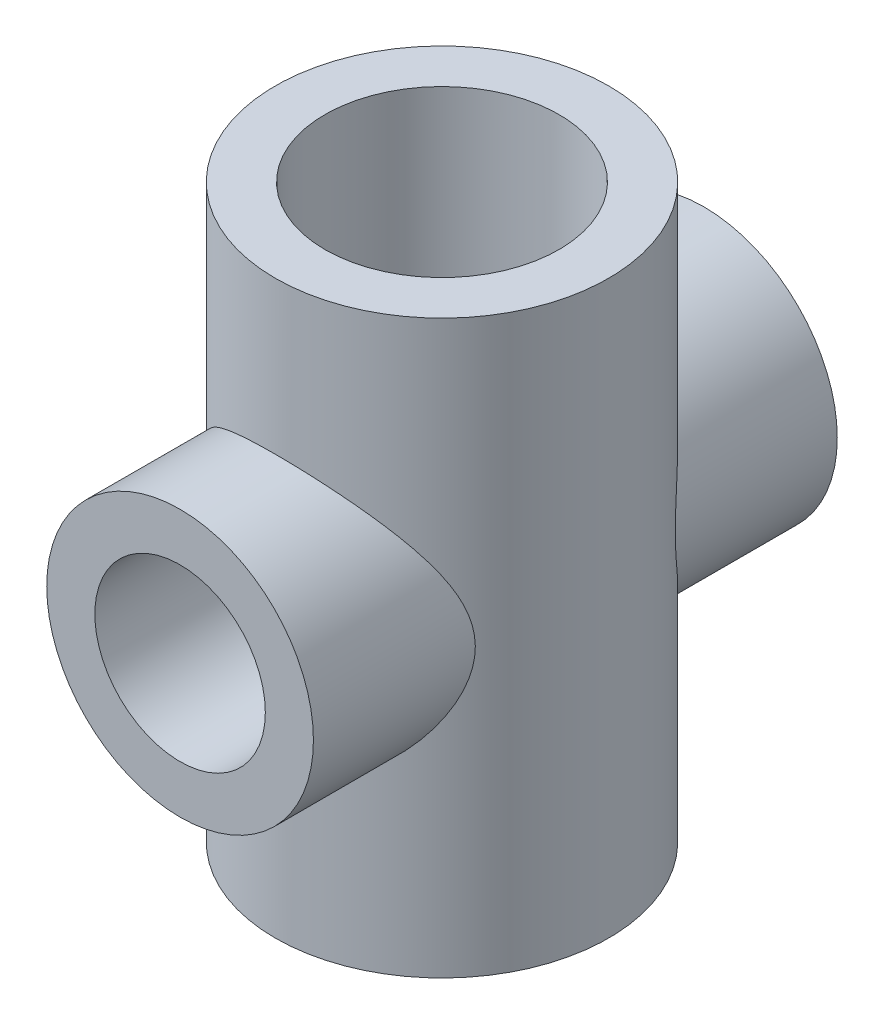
from build123d import *

# Parameters (mm, degrees)
SKETCH_1_R          = 35
EXTRUDE_1_DEPTH     = 120
SKETCH_2_R          = 28
EXTRUDE_3_DEPTH     = 55
SKETCH_3_R          = 24.571528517
CUT_EXTRUDE_1_DEPTH = 148.5
SKETCH_5_R          = 17.902484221
CUT_EXTRUDE_2_DEPTH = 148.5


with BuildPart() as part:
    # Sketch 1 → Extrude 1 (new body)
    with BuildSketch(Plane(origin=(0, 0, 0), x_dir=(1, 0, 0), z_dir=(0, 1, 0))):
        with Locations(Location((0, 0, 0), (0, 0, 270))):
            Circle(SKETCH_1_R)
    extrude(amount=EXTRUDE_1_DEPTH)

    # Sketch 2 → Extrude 3 (add, symmetric)
    with BuildSketch(Plane.XY):
        with Locations(Location((0, 60, 0), (0, 0, 180))):
            Circle(SKETCH_2_R)
    extrude(amount=EXTRUDE_3_DEPTH, both=True)

    # Sketch 3 → Cut-Extrude 1 (cut, symmetric)
    with BuildSketch(Plane(origin=(0, 0, 0), x_dir=(1, 0, 0), z_dir=(0, 1, 0))):
        with Locations(Location((0, 0, 0), (0, 0, 270))):
            Circle(SKETCH_3_R)
    extrude(amount=CUT_EXTRUDE_1_DEPTH, both=True, mode=Mode.SUBTRACT)

    # Sketch 5 → Cut-Extrude 2 (cut, symmetric)
    with BuildSketch(Plane.XY):
        with Locations((0, 60)):
            Circle(SKETCH_5_R)
    extrude(amount=CUT_EXTRUDE_2_DEPTH, both=True, mode=Mode.SUBTRACT)


solid = part.part
